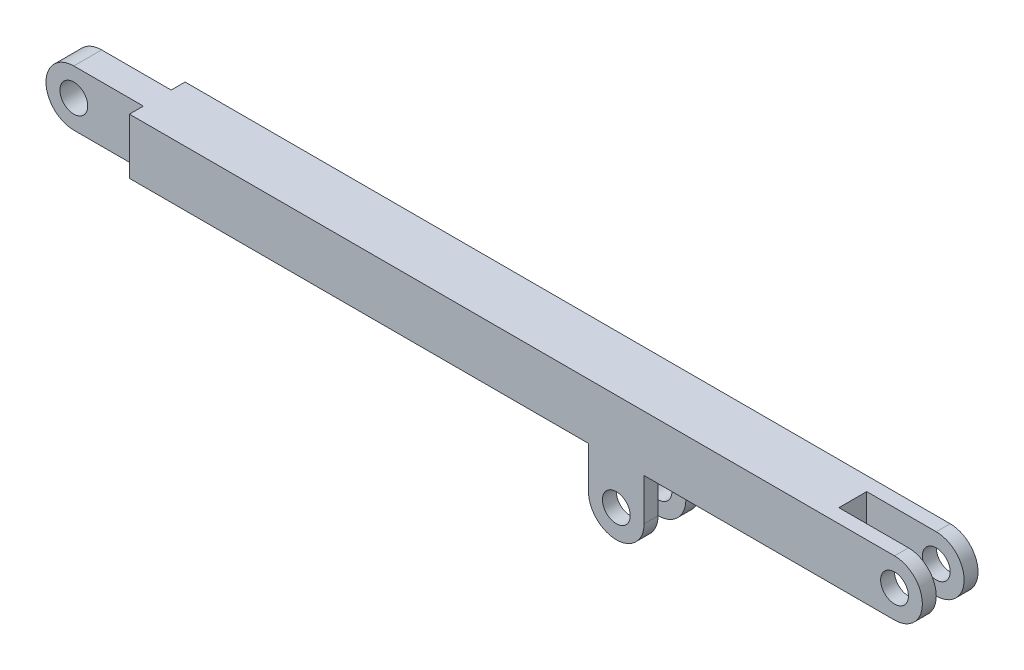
ISO-10303-21;
HEADER;
FILE_DESCRIPTION(('STEP AP214'),'2;1');
FILE_NAME('part.step','',(''),(''),'','','');
FILE_SCHEMA(('AUTOMOTIVE_DESIGN { 1 0 10303 214 1 1 1 1 }'));
ENDSEC;
DATA;
#1=APPLICATION_CONTEXT('core data for automotive mechanical design processes');
#2=APPLICATION_PROTOCOL_DEFINITION('international standard','automotive_design',2000,#1);
#3=PRODUCT_CONTEXT('',#1,'mechanical');
#4=PRODUCT('Part','Part','',(#3));
#5=PRODUCT_RELATED_PRODUCT_CATEGORY('part','',(#4));
#6=PRODUCT_DEFINITION_FORMATION('','',#4);
#7=PRODUCT_DEFINITION_CONTEXT('part definition',#1,'design');
#8=PRODUCT_DEFINITION('design','',#6,#7);
#9=PRODUCT_DEFINITION_SHAPE('','',#8);
#10=(LENGTH_UNIT() NAMED_UNIT(*) SI_UNIT(.MILLI.,.METRE.));
#11=(NAMED_UNIT(*) PLANE_ANGLE_UNIT() SI_UNIT($,.RADIAN.));
#12=(NAMED_UNIT(*) SI_UNIT($,.STERADIAN.) SOLID_ANGLE_UNIT());
#13=UNCERTAINTY_MEASURE_WITH_UNIT(LENGTH_MEASURE(1.E-05),#10,'distance_accuracy_value','');
#14=(GEOMETRIC_REPRESENTATION_CONTEXT(3) GLOBAL_UNCERTAINTY_ASSIGNED_CONTEXT((#13)) GLOBAL_UNIT_ASSIGNED_CONTEXT((#10,
#11,#12)) REPRESENTATION_CONTEXT('',''));
#15=CARTESIAN_POINT('',(0.,0.,0.));
#16=DIRECTION('',(0.,0.,1.));
#17=DIRECTION('',(1.,0.,0.));
#18=AXIS2_PLACEMENT_3D('',#15,#16,#17);
#19=CARTESIAN_POINT('',(760.,-100.,40.));
#20=DIRECTION('',(1.,0.,0.));
#21=DIRECTION('',(0.,0.,-1.));
#22=AXIS2_PLACEMENT_3D('',#19,#20,#21);
#23=PLANE('',#22);
#24=DIRECTION('',(0.,-1.,0.));
#25=VECTOR('',#24,1.);
#26=CARTESIAN_POINT('',(760.,-100.,20.));
#27=LINE('',#26,#25);
#28=CARTESIAN_POINT('',(760.,-40.,20.));
#29=VERTEX_POINT('',#28);
#30=CARTESIAN_POINT('',(760.,-100.,20.));
#31=VERTEX_POINT('',#30);
#32=EDGE_CURVE('E380',#29,#31,#27,.T.);
#33=ORIENTED_EDGE('',*,*,#32,.T.);
#34=DIRECTION('',(0.,0.,-1.));
#35=VECTOR('',#34,1.);
#36=CARTESIAN_POINT('',(760.,-100.,40.));
#37=LINE('',#36,#35);
#38=CARTESIAN_POINT('',(760.,-100.,40.));
#39=VERTEX_POINT('',#38);
#40=EDGE_CURVE('E193',#39,#31,#37,.T.);
#41=ORIENTED_EDGE('',*,*,#40,.F.);
#42=DIRECTION('',(0.,-1.,0.));
#43=VECTOR('',#42,1.);
#44=CARTESIAN_POINT('',(760.,-100.,40.));
#45=LINE('',#44,#43);
#46=CARTESIAN_POINT('',(760.,-40.,40.));
#47=VERTEX_POINT('',#46);
#48=EDGE_CURVE('E359',#47,#39,#45,.T.);
#49=ORIENTED_EDGE('',*,*,#48,.F.);
#50=DIRECTION('',(0.,0.,-1.));
#51=VECTOR('',#50,1.);
#52=CARTESIAN_POINT('',(760.,-40.,40.));
#53=LINE('',#52,#51);
#54=EDGE_CURVE('E352',#47,#29,#53,.T.);
#55=ORIENTED_EDGE('',*,*,#54,.T.);
#56=EDGE_LOOP('',(#33,#41,#49,#55));
#57=FACE_BOUND('',#56,.T.);
#58=ADVANCED_FACE('F32',(#57),#23,.F.);
#59=CARTESIAN_POINT('',(800.,-100.,40.));
#60=DIRECTION('',(0.,0.,-1.));
#61=DIRECTION('',(-1.,0.,0.));
#62=AXIS2_PLACEMENT_3D('',#59,#60,#61);
#63=CYLINDRICAL_SURFACE('',#62,40.);
#64=CARTESIAN_POINT('',(800.,-100.,20.));
#65=DIRECTION('',(0.,0.,1.));
#66=DIRECTION('',(-1.,0.,0.));
#67=AXIS2_PLACEMENT_3D('',#64,#65,#66);
#68=CIRCLE('',#67,40.);
#69=CARTESIAN_POINT('',(840.,-100.,20.));
#70=VERTEX_POINT('',#69);
#71=EDGE_CURVE('E377',#31,#70,#68,.T.);
#72=ORIENTED_EDGE('',*,*,#71,.T.);
#73=DIRECTION('',(0.,0.,-1.));
#74=VECTOR('',#73,1.);
#75=CARTESIAN_POINT('',(840.,-100.,40.));
#76=LINE('',#75,#74);
#77=CARTESIAN_POINT('',(840.,-100.,40.));
#78=VERTEX_POINT('',#77);
#79=EDGE_CURVE('E194',#78,#70,#76,.T.);
#80=ORIENTED_EDGE('',*,*,#79,.F.);
#81=CARTESIAN_POINT('',(800.,-100.,40.));
#82=DIRECTION('',(0.,0.,1.));
#83=DIRECTION('',(-1.,0.,0.));
#84=AXIS2_PLACEMENT_3D('',#81,#82,#83);
#85=CIRCLE('',#84,40.);
#86=EDGE_CURVE('E365',#39,#78,#85,.T.);
#87=ORIENTED_EDGE('',*,*,#86,.F.);
#88=ORIENTED_EDGE('',*,*,#40,.T.);
#89=EDGE_LOOP('',(#72,#80,#87,#88));
#90=FACE_BOUND('',#89,.T.);
#91=ADVANCED_FACE('F408',(#90),#63,.T.);
#92=CARTESIAN_POINT('',(840.,-40.,40.));
#93=DIRECTION('',(-1.,0.,0.));
#94=DIRECTION('',(0.,0.,1.));
#95=AXIS2_PLACEMENT_3D('',#92,#93,#94);
#96=PLANE('',#95);
#97=DIRECTION('',(0.,1.,0.));
#98=VECTOR('',#97,1.);
#99=CARTESIAN_POINT('',(840.,-40.,20.));
#100=LINE('',#99,#98);
#101=CARTESIAN_POINT('',(840.,-40.,20.));
#102=VERTEX_POINT('',#101);
#103=EDGE_CURVE('E375',#70,#102,#100,.T.);
#104=ORIENTED_EDGE('',*,*,#103,.T.);
#105=DIRECTION('',(0.,0.,-1.));
#106=VECTOR('',#105,1.);
#107=CARTESIAN_POINT('',(840.,-40.,40.));
#108=LINE('',#107,#106);
#109=CARTESIAN_POINT('',(840.,-40.,40.));
#110=VERTEX_POINT('',#109);
#111=EDGE_CURVE('E54',#110,#102,#108,.T.);
#112=ORIENTED_EDGE('',*,*,#111,.F.);
#113=DIRECTION('',(0.,1.,0.));
#114=VECTOR('',#113,1.);
#115=CARTESIAN_POINT('',(840.,-40.,40.));
#116=LINE('',#115,#114);
#117=EDGE_CURVE('E348',#78,#110,#116,.T.);
#118=ORIENTED_EDGE('',*,*,#117,.F.);
#119=ORIENTED_EDGE('',*,*,#79,.T.);
#120=EDGE_LOOP('',(#104,#112,#118,#119));
#121=FACE_BOUND('',#120,.T.);
#122=ADVANCED_FACE('F414',(#121),#96,.F.);
#123=CARTESIAN_POINT('',(800.,-100.,40.));
#124=DIRECTION('',(0.,0.,-1.));
#125=DIRECTION('',(-1.,0.,0.));
#126=AXIS2_PLACEMENT_3D('',#123,#124,#125);
#127=CYLINDRICAL_SURFACE('',#126,20.);
#128=CARTESIAN_POINT('',(800.,-100.,40.));
#129=DIRECTION('',(0.,0.,1.));
#130=DIRECTION('',(1.,0.,0.));
#131=AXIS2_PLACEMENT_3D('',#128,#129,#130);
#132=CIRCLE('',#131,20.);
#133=CARTESIAN_POINT('',(820.,-100.,40.));
#134=VERTEX_POINT('',#133);
#135=EDGE_CURVE('E363',#134,#134,#132,.T.);
#136=ORIENTED_EDGE('',*,*,#135,.T.);
#137=EDGE_LOOP('',(#136));
#138=FACE_BOUND('',#137,.T.);
#139=CARTESIAN_POINT('',(800.,-100.,20.));
#140=DIRECTION('',(0.,0.,1.));
#141=DIRECTION('',(1.,0.,0.));
#142=AXIS2_PLACEMENT_3D('',#139,#140,#141);
#143=CIRCLE('',#142,20.);
#144=CARTESIAN_POINT('',(820.,-100.,20.));
#145=VERTEX_POINT('',#144);
#146=EDGE_CURVE('E386',#145,#145,#143,.T.);
#147=ORIENTED_EDGE('',*,*,#146,.F.);
#148=EDGE_LOOP('',(#147));
#149=FACE_BOUND('',#148,.T.);
#150=ADVANCED_FACE('F406',(#138,#149),#127,.F.);
#151=CARTESIAN_POINT('',(0.,-40.,20.));
#152=DIRECTION('',(0.,1.,0.));
#153=DIRECTION('',(0.,0.,1.));
#154=AXIS2_PLACEMENT_3D('',#151,#152,#153);
#155=PLANE('',#154);
#156=ORIENTED_EDGE('',*,*,#111,.T.);
#157=DIRECTION('',(-1.,0.,0.));
#158=VECTOR('',#157,1.);
#159=CARTESIAN_POINT('',(760.,-40.,20.));
#160=LINE('',#159,#158);
#161=EDGE_CURVE('E47',#102,#29,#160,.T.);
#162=ORIENTED_EDGE('',*,*,#161,.T.);
#163=ORIENTED_EDGE('',*,*,#54,.F.);
#164=DIRECTION('',(1.,0.,0.));
#165=VECTOR('',#164,1.);
#166=CARTESIAN_POINT('',(99.9999999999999,-40.0000000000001,40.));
#167=LINE('',#166,#165);
#168=CARTESIAN_POINT('',(99.9999999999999,-40.0000000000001,40.));
#169=VERTEX_POINT('',#168);
#170=EDGE_CURVE('E250',#169,#47,#167,.T.);
#171=ORIENTED_EDGE('',*,*,#170,.F.);
#172=DIRECTION('',(0.,0.,-1.));
#173=VECTOR('',#172,1.);
#174=CARTESIAN_POINT('',(99.9999999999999,-40.0000000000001,40.));
#175=LINE('',#174,#173);
#176=CARTESIAN_POINT('',(99.9999999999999,-40.,20.));
#177=VERTEX_POINT('',#176);
#178=EDGE_CURVE('E265',#169,#177,#175,.T.);
#179=ORIENTED_EDGE('',*,*,#178,.T.);
#180=DIRECTION('',(1.,0.,0.));
#181=VECTOR('',#180,1.);
#182=CARTESIAN_POINT('',(0.,-40.,20.));
#183=LINE('',#182,#181);
#184=CARTESIAN_POINT('',(0.,-40.,20.));
#185=VERTEX_POINT('',#184);
#186=EDGE_CURVE('E286',#185,#177,#183,.T.);
#187=ORIENTED_EDGE('',*,*,#186,.F.);
#188=DIRECTION('',(0.,0.,-1.));
#189=VECTOR('',#188,1.);
#190=CARTESIAN_POINT('',(0.,-40.,20.));
#191=LINE('',#190,#189);
#192=CARTESIAN_POINT('',(0.,-40.,-20.));
#193=VERTEX_POINT('',#192);
#194=EDGE_CURVE('E11',#185,#193,#191,.T.);
#195=ORIENTED_EDGE('',*,*,#194,.T.);
#196=DIRECTION('',(1.,0.,0.));
#197=VECTOR('',#196,1.);
#198=CARTESIAN_POINT('',(0.,-40.,-20.));
#199=LINE('',#198,#197);
#200=CARTESIAN_POINT('',(99.9999999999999,-40.0000000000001,-20.));
#201=VERTEX_POINT('',#200);
#202=EDGE_CURVE('E294',#193,#201,#199,.T.);
#203=ORIENTED_EDGE('',*,*,#202,.T.);
#204=CARTESIAN_POINT('',(99.9999999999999,-40.0000000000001,-40.));
#205=VERTEX_POINT('',#204);
#206=EDGE_CURVE('E253',#201,#205,#175,.T.);
#207=ORIENTED_EDGE('',*,*,#206,.T.);
#208=DIRECTION('',(1.,0.,0.));
#209=VECTOR('',#208,1.);
#210=CARTESIAN_POINT('',(99.9999999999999,-40.0000000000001,-40.));
#211=LINE('',#210,#209);
#212=CARTESIAN_POINT('',(760.,-40.,-40.));
#213=VERTEX_POINT('',#212);
#214=EDGE_CURVE('E245',#205,#213,#211,.T.);
#215=ORIENTED_EDGE('',*,*,#214,.T.);
#216=CARTESIAN_POINT('',(760.,-40.,-20.));
#217=VERTEX_POINT('',#216);
#218=EDGE_CURVE('E355',#217,#213,#53,.T.);
#219=ORIENTED_EDGE('',*,*,#218,.F.);
#220=DIRECTION('',(-1.,0.,0.));
#221=VECTOR('',#220,1.);
#222=CARTESIAN_POINT('',(760.,-40.,-20.));
#223=LINE('',#222,#221);
#224=CARTESIAN_POINT('',(840.,-40.,-20.));
#225=VERTEX_POINT('',#224);
#226=EDGE_CURVE('E175',#225,#217,#223,.T.);
#227=ORIENTED_EDGE('',*,*,#226,.F.);
#228=CARTESIAN_POINT('',(840.,-40.,-40.));
#229=VERTEX_POINT('',#228);
#230=EDGE_CURVE('E351',#225,#229,#108,.T.);
#231=ORIENTED_EDGE('',*,*,#230,.T.);
#232=CARTESIAN_POINT('',(1200.,-40.,-40.));
#233=VERTEX_POINT('',#232);
#234=EDGE_CURVE('E262',#229,#233,#211,.T.);
#235=ORIENTED_EDGE('',*,*,#234,.T.);
#236=DIRECTION('',(0.,0.,-1.));
#237=VECTOR('',#236,1.);
#238=CARTESIAN_POINT('',(1200.,-40.,20.));
#239=LINE('',#238,#237);
#240=CARTESIAN_POINT('',(1200.,-40.,-20.));
#241=VERTEX_POINT('',#240);
#242=EDGE_CURVE('E303',#241,#233,#239,.T.);
#243=ORIENTED_EDGE('',*,*,#242,.F.);
#244=DIRECTION('',(1.,0.,0.));
#245=VECTOR('',#244,1.);
#246=CARTESIAN_POINT('',(1100.,-40.,-20.));
#247=LINE('',#246,#245);
#248=CARTESIAN_POINT('',(1100.,-40.,-20.));
#249=VERTEX_POINT('',#248);
#250=EDGE_CURVE('E217',#249,#241,#247,.T.);
#251=ORIENTED_EDGE('',*,*,#250,.F.);
#252=DIRECTION('',(0.,0.,1.));
#253=VECTOR('',#252,1.);
#254=CARTESIAN_POINT('',(1100.,-40.,-20.));
#255=LINE('',#254,#253);
#256=CARTESIAN_POINT('',(1100.,-40.,20.));
#257=VERTEX_POINT('',#256);
#258=EDGE_CURVE('E229',#249,#257,#255,.T.);
#259=ORIENTED_EDGE('',*,*,#258,.T.);
#260=DIRECTION('',(1.,0.,0.));
#261=VECTOR('',#260,1.);
#262=CARTESIAN_POINT('',(1100.,-40.,20.));
#263=LINE('',#262,#261);
#264=CARTESIAN_POINT('',(1200.,-40.,20.));
#265=VERTEX_POINT('',#264);
#266=EDGE_CURVE('E211',#257,#265,#263,.T.);
#267=ORIENTED_EDGE('',*,*,#266,.T.);
#268=CARTESIAN_POINT('',(1200.,-40.,40.));
#269=VERTEX_POINT('',#268);
#270=EDGE_CURVE('E40',#269,#265,#239,.T.);
#271=ORIENTED_EDGE('',*,*,#270,.F.);
#272=EDGE_CURVE('E249',#110,#269,#167,.T.);
#273=ORIENTED_EDGE('',*,*,#272,.F.);
#274=EDGE_LOOP('',(#156,#162,#163,#171,#179,#187,#195,#203,#207,#215,#219,#227,#231,#235,#243,
#251,#259,#267,#271,#273));
#275=FACE_BOUND('',#274,.T.);
#276=ADVANCED_FACE('F333',(#275),#155,.F.);
#277=CARTESIAN_POINT('',(1200.,0.,20.));
#278=DIRECTION('',(0.,0.,-1.));
#279=DIRECTION('',(-1.,0.,0.));
#280=AXIS2_PLACEMENT_3D('',#277,#278,#279);
#281=CYLINDRICAL_SURFACE('',#280,40.);
#282=CARTESIAN_POINT('',(1200.,0.,-20.));
#283=DIRECTION('',(0.,0.,1.));
#284=DIRECTION('',(1.,0.,0.));
#285=AXIS2_PLACEMENT_3D('',#282,#283,#284);
#286=CIRCLE('',#285,40.);
#287=CARTESIAN_POINT('',(1200.,40.,-20.));
#288=VERTEX_POINT('',#287);
#289=EDGE_CURVE('E208',#241,#288,#286,.T.);
#290=ORIENTED_EDGE('',*,*,#289,.F.);
#291=ORIENTED_EDGE('',*,*,#242,.T.);
#292=CARTESIAN_POINT('',(1200.,0.,-40.));
#293=DIRECTION('',(0.,0.,1.));
#294=DIRECTION('',(1.,0.,0.));
#295=AXIS2_PLACEMENT_3D('',#292,#293,#294);
#296=CIRCLE('',#295,40.);
#297=CARTESIAN_POINT('',(1200.,40.,-40.));
#298=VERTEX_POINT('',#297);
#299=EDGE_CURVE('E238',#233,#298,#296,.T.);
#300=ORIENTED_EDGE('',*,*,#299,.T.);
#301=DIRECTION('',(0.,0.,-1.));
#302=VECTOR('',#301,1.);
#303=CARTESIAN_POINT('',(1200.,40.,20.));
#304=LINE('',#303,#302);
#305=EDGE_CURVE('E300',#288,#298,#304,.T.);
#306=ORIENTED_EDGE('',*,*,#305,.F.);
#307=EDGE_LOOP('',(#290,#291,#300,#306));
#308=FACE_BOUND('',#307,.T.);
#309=ADVANCED_FACE('F313',(#308),#281,.T.);
#310=CARTESIAN_POINT('',(0.,40.,20.));
#311=DIRECTION('',(0.,-1.,0.));
#312=DIRECTION('',(0.,0.,-1.));
#313=AXIS2_PLACEMENT_3D('',#310,#311,#312);
#314=PLANE('',#313);
#315=DIRECTION('',(-1.,0.,0.));
#316=VECTOR('',#315,1.);
#317=CARTESIAN_POINT('',(1100.,40.0000000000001,-20.));
#318=LINE('',#317,#316);
#319=CARTESIAN_POINT('',(1100.,40.0000000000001,-20.));
#320=VERTEX_POINT('',#319);
#321=EDGE_CURVE('E210',#288,#320,#318,.T.);
#322=ORIENTED_EDGE('',*,*,#321,.F.);
#323=ORIENTED_EDGE('',*,*,#305,.T.);
#324=DIRECTION('',(-1.,0.,0.));
#325=VECTOR('',#324,1.);
#326=CARTESIAN_POINT('',(99.9999999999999,40.,-40.));
#327=LINE('',#326,#325);
#328=CARTESIAN_POINT('',(99.9999999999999,40.,-40.));
#329=VERTEX_POINT('',#328);
#330=EDGE_CURVE('E256',#298,#329,#327,.T.);
#331=ORIENTED_EDGE('',*,*,#330,.T.);
#332=DIRECTION('',(0.,0.,-1.));
#333=VECTOR('',#332,1.);
#334=CARTESIAN_POINT('',(99.9999999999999,40.,40.));
#335=LINE('',#334,#333);
#336=CARTESIAN_POINT('',(99.9999999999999,40.,-20.));
#337=VERTEX_POINT('',#336);
#338=EDGE_CURVE('E268',#337,#329,#335,.T.);
#339=ORIENTED_EDGE('',*,*,#338,.F.);
#340=DIRECTION('',(-1.,0.,0.));
#341=VECTOR('',#340,1.);
#342=CARTESIAN_POINT('',(0.,40.,-20.));
#343=LINE('',#342,#341);
#344=CARTESIAN_POINT('',(0.,40.,-20.));
#345=VERTEX_POINT('',#344);
#346=EDGE_CURVE('E287',#337,#345,#343,.T.);
#347=ORIENTED_EDGE('',*,*,#346,.T.);
#348=DIRECTION('',(0.,0.,-1.));
#349=VECTOR('',#348,1.);
#350=CARTESIAN_POINT('',(0.,40.,20.));
#351=LINE('',#350,#349);
#352=CARTESIAN_POINT('',(0.,40.,20.));
#353=VERTEX_POINT('',#352);
#354=EDGE_CURVE('E291',#353,#345,#351,.T.);
#355=ORIENTED_EDGE('',*,*,#354,.F.);
#356=DIRECTION('',(-1.,0.,0.));
#357=VECTOR('',#356,1.);
#358=CARTESIAN_POINT('',(0.,40.,20.));
#359=LINE('',#358,#357);
#360=CARTESIAN_POINT('',(99.9999999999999,40.,20.));
#361=VERTEX_POINT('',#360);
#362=EDGE_CURVE('E289',#361,#353,#359,.T.);
#363=ORIENTED_EDGE('',*,*,#362,.F.);
#364=CARTESIAN_POINT('',(99.9999999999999,40.,40.));
#365=VERTEX_POINT('',#364);
#366=EDGE_CURVE('E269',#365,#361,#335,.T.);
#367=ORIENTED_EDGE('',*,*,#366,.F.);
#368=DIRECTION('',(-1.,0.,0.));
#369=VECTOR('',#368,1.);
#370=CARTESIAN_POINT('',(99.9999999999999,40.,40.));
#371=LINE('',#370,#369);
#372=CARTESIAN_POINT('',(1200.,40.,40.));
#373=VERTEX_POINT('',#372);
#374=EDGE_CURVE('E244',#373,#365,#371,.T.);
#375=ORIENTED_EDGE('',*,*,#374,.F.);
#376=CARTESIAN_POINT('',(1200.,40.,20.));
#377=VERTEX_POINT('',#376);
#378=EDGE_CURVE('E301',#373,#377,#304,.T.);
#379=ORIENTED_EDGE('',*,*,#378,.T.);
#380=DIRECTION('',(-1.,0.,0.));
#381=VECTOR('',#380,1.);
#382=CARTESIAN_POINT('',(1100.,40.0000000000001,20.));
#383=LINE('',#382,#381);
#384=CARTESIAN_POINT('',(1100.,40.,20.));
#385=VERTEX_POINT('',#384);
#386=EDGE_CURVE('E222',#377,#385,#383,.T.);
#387=ORIENTED_EDGE('',*,*,#386,.T.);
#388=DIRECTION('',(0.,0.,1.));
#389=VECTOR('',#388,1.);
#390=CARTESIAN_POINT('',(1100.,40.0000000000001,-20.));
#391=LINE('',#390,#389);
#392=EDGE_CURVE('E219',#320,#385,#391,.T.);
#393=ORIENTED_EDGE('',*,*,#392,.F.);
#394=EDGE_LOOP('',(#322,#323,#331,#339,#347,#355,#363,#367,#375,#379,#387,#393));
#395=FACE_BOUND('',#394,.T.);
#396=ADVANCED_FACE('F328',(#395),#314,.F.);
#397=CARTESIAN_POINT('',(1200.,0.,20.));
#398=DIRECTION('',(0.,0.,-1.));
#399=DIRECTION('',(-1.,0.,0.));
#400=AXIS2_PLACEMENT_3D('',#397,#398,#399);
#401=CYLINDRICAL_SURFACE('',#400,20.);
#402=CARTESIAN_POINT('',(1200.,0.,-40.));
#403=DIRECTION('',(0.,0.,1.));
#404=DIRECTION('',(1.,0.,0.));
#405=AXIS2_PLACEMENT_3D('',#402,#403,#404);
#406=CIRCLE('',#405,20.);
#407=CARTESIAN_POINT('',(1220.,0.,-40.));
#408=VERTEX_POINT('',#407);
#409=EDGE_CURVE('E232',#408,#408,#406,.T.);
#410=ORIENTED_EDGE('',*,*,#409,.F.);
#411=EDGE_LOOP('',(#410));
#412=FACE_BOUND('',#411,.T.);
#413=CARTESIAN_POINT('',(1200.,0.,-20.));
#414=DIRECTION('',(0.,0.,1.));
#415=DIRECTION('',(1.,0.,0.));
#416=AXIS2_PLACEMENT_3D('',#413,#414,#415);
#417=CIRCLE('',#416,20.);
#418=CARTESIAN_POINT('',(1220.,0.,-20.));
#419=VERTEX_POINT('',#418);
#420=EDGE_CURVE('E202',#419,#419,#417,.T.);
#421=ORIENTED_EDGE('',*,*,#420,.T.);
#422=EDGE_LOOP('',(#421));
#423=FACE_BOUND('',#422,.T.);
#424=ADVANCED_FACE('F445',(#412,#423),#401,.F.);
#425=CARTESIAN_POINT('',(0.,0.,20.));
#426=DIRECTION('',(0.,0.,1.));
#427=DIRECTION('',(1.,0.,0.));
#428=AXIS2_PLACEMENT_3D('',#425,#426,#427);
#429=PLANE('',#428);
#430=CARTESIAN_POINT('',(0.,0.,20.));
#431=DIRECTION('',(0.,0.,1.));
#432=DIRECTION('',(1.,0.,0.));
#433=AXIS2_PLACEMENT_3D('',#430,#431,#432);
#434=CIRCLE('',#433,20.);
#435=CARTESIAN_POINT('',(20.,0.,20.));
#436=VERTEX_POINT('',#435);
#437=EDGE_CURVE('E277',#436,#436,#434,.T.);
#438=ORIENTED_EDGE('',*,*,#437,.F.);
#439=EDGE_LOOP('',(#438));
#440=FACE_BOUND('',#439,.T.);
#441=ORIENTED_EDGE('',*,*,#186,.T.);
#442=DIRECTION('',(0.,1.,0.));
#443=VECTOR('',#442,1.);
#444=CARTESIAN_POINT('',(99.9999999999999,0.,20.));
#445=LINE('',#444,#443);
#446=EDGE_CURVE('E274',#177,#361,#445,.T.);
#447=ORIENTED_EDGE('',*,*,#446,.T.);
#448=ORIENTED_EDGE('',*,*,#362,.T.);
#449=CARTESIAN_POINT('',(0.,0.,20.));
#450=DIRECTION('',(0.,0.,1.));
#451=DIRECTION('',(1.,0.,0.));
#452=AXIS2_PLACEMENT_3D('',#449,#450,#451);
#453=CIRCLE('',#452,40.);
#454=EDGE_CURVE('E283',#353,#185,#453,.T.);
#455=ORIENTED_EDGE('',*,*,#454,.T.);
#456=EDGE_LOOP('',(#441,#447,#448,#455));
#457=FACE_BOUND('',#456,.T.);
#458=ADVANCED_FACE('F450',(#440,#457),#429,.T.);
#459=CARTESIAN_POINT('',(0.,0.,-20.));
#460=DIRECTION('',(0.,0.,1.));
#461=DIRECTION('',(1.,0.,0.));
#462=AXIS2_PLACEMENT_3D('',#459,#460,#461);
#463=PLANE('',#462);
#464=CARTESIAN_POINT('',(0.,0.,-20.));
#465=DIRECTION('',(0.,0.,1.));
#466=DIRECTION('',(1.,0.,0.));
#467=AXIS2_PLACEMENT_3D('',#464,#465,#466);
#468=CIRCLE('',#467,20.);
#469=CARTESIAN_POINT('',(20.,0.,-20.));
#470=VERTEX_POINT('',#469);
#471=EDGE_CURVE('E276',#470,#470,#468,.T.);
#472=ORIENTED_EDGE('',*,*,#471,.T.);
#473=EDGE_LOOP('',(#472));
#474=FACE_BOUND('',#473,.T.);
#475=DIRECTION('',(0.,1.,0.));
#476=VECTOR('',#475,1.);
#477=CARTESIAN_POINT('',(99.9999999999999,0.,-20.));
#478=LINE('',#477,#476);
#479=EDGE_CURVE('E272',#201,#337,#478,.T.);
#480=ORIENTED_EDGE('',*,*,#479,.F.);
#481=ORIENTED_EDGE('',*,*,#202,.F.);
#482=CARTESIAN_POINT('',(0.,0.,-20.));
#483=DIRECTION('',(0.,0.,1.));
#484=DIRECTION('',(1.,0.,0.));
#485=AXIS2_PLACEMENT_3D('',#482,#483,#484);
#486=CIRCLE('',#485,40.);
#487=EDGE_CURVE('E280',#345,#193,#486,.T.);
#488=ORIENTED_EDGE('',*,*,#487,.F.);
#489=ORIENTED_EDGE('',*,*,#346,.F.);
#490=EDGE_LOOP('',(#480,#481,#488,#489));
#491=FACE_BOUND('',#490,.T.);
#492=ADVANCED_FACE('F453',(#474,#491),#463,.F.);
#493=CARTESIAN_POINT('',(0.,0.,20.));
#494=DIRECTION('',(0.,0.,-1.));
#495=DIRECTION('',(-1.,0.,0.));
#496=AXIS2_PLACEMENT_3D('',#493,#494,#495);
#497=CYLINDRICAL_SURFACE('',#496,40.);
#498=ORIENTED_EDGE('',*,*,#487,.T.);
#499=ORIENTED_EDGE('',*,*,#194,.F.);
#500=ORIENTED_EDGE('',*,*,#454,.F.);
#501=ORIENTED_EDGE('',*,*,#354,.T.);
#502=EDGE_LOOP('',(#498,#499,#500,#501));
#503=FACE_BOUND('',#502,.T.);
#504=ADVANCED_FACE('F34',(#503),#497,.T.);
#505=ORIENTED_EDGE('',*,*,#270,.T.);
#506=CARTESIAN_POINT('',(1200.,0.,20.));
#507=DIRECTION('',(0.,0.,1.));
#508=DIRECTION('',(1.,0.,0.));
#509=AXIS2_PLACEMENT_3D('',#506,#507,#508);
#510=CIRCLE('',#509,40.);
#511=EDGE_CURVE('E205',#265,#377,#510,.T.);
#512=ORIENTED_EDGE('',*,*,#511,.T.);
#513=ORIENTED_EDGE('',*,*,#378,.F.);
#514=CARTESIAN_POINT('',(1200.,0.,40.));
#515=DIRECTION('',(0.,0.,1.));
#516=DIRECTION('',(1.,0.,0.));
#517=AXIS2_PLACEMENT_3D('',#514,#515,#516);
#518=CIRCLE('',#517,40.);
#519=EDGE_CURVE('E241',#269,#373,#518,.T.);
#520=ORIENTED_EDGE('',*,*,#519,.F.);
#521=EDGE_LOOP('',(#505,#512,#513,#520));
#522=FACE_BOUND('',#521,.T.);
#523=ADVANCED_FACE('F339',(#522),#281,.T.);
#524=CARTESIAN_POINT('',(0.,0.,20.));
#525=DIRECTION('',(0.,0.,-1.));
#526=DIRECTION('',(-1.,0.,0.));
#527=AXIS2_PLACEMENT_3D('',#524,#525,#526);
#528=CYLINDRICAL_SURFACE('',#527,20.);
#529=ORIENTED_EDGE('',*,*,#437,.T.);
#530=EDGE_LOOP('',(#529));
#531=FACE_BOUND('',#530,.T.);
#532=ORIENTED_EDGE('',*,*,#471,.F.);
#533=EDGE_LOOP('',(#532));
#534=FACE_BOUND('',#533,.T.);
#535=ADVANCED_FACE('F446',(#531,#534),#528,.F.);
#536=CARTESIAN_POINT('',(99.9999999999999,40.,40.));
#537=DIRECTION('',(1.,0.,0.));
#538=DIRECTION('',(0.,1.,0.));
#539=AXIS2_PLACEMENT_3D('',#536,#537,#538);
#540=PLANE('',#539);
#541=ORIENTED_EDGE('',*,*,#206,.F.);
#542=ORIENTED_EDGE('',*,*,#479,.T.);
#543=ORIENTED_EDGE('',*,*,#338,.T.);
#544=DIRECTION('',(0.,-1.,0.));
#545=VECTOR('',#544,1.);
#546=CARTESIAN_POINT('',(99.9999999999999,40.,-40.));
#547=LINE('',#546,#545);
#548=EDGE_CURVE('E259',#329,#205,#547,.T.);
#549=ORIENTED_EDGE('',*,*,#548,.T.);
#550=EDGE_LOOP('',(#541,#542,#543,#549));
#551=FACE_BOUND('',#550,.T.);
#552=ADVANCED_FACE('F438',(#551),#540,.F.);
#553=CARTESIAN_POINT('',(1200.,0.,-40.));
#554=DIRECTION('',(0.,0.,1.));
#555=DIRECTION('',(1.,0.,0.));
#556=AXIS2_PLACEMENT_3D('',#553,#554,#555);
#557=PLANE('',#556);
#558=ORIENTED_EDGE('',*,*,#299,.F.);
#559=ORIENTED_EDGE('',*,*,#234,.F.);
#560=DIRECTION('',(0.,1.,0.));
#561=VECTOR('',#560,1.);
#562=CARTESIAN_POINT('',(840.,-40.,-40.));
#563=LINE('',#562,#561);
#564=CARTESIAN_POINT('',(840.,-100.,-40.));
#565=VERTEX_POINT('',#564);
#566=EDGE_CURVE('E356',#565,#229,#563,.T.);
#567=ORIENTED_EDGE('',*,*,#566,.F.);
#568=CARTESIAN_POINT('',(800.,-100.,-40.));
#569=DIRECTION('',(0.,0.,1.));
#570=DIRECTION('',(-1.,0.,0.));
#571=AXIS2_PLACEMENT_3D('',#568,#569,#570);
#572=CIRCLE('',#571,40.);
#573=CARTESIAN_POINT('',(760.,-100.,-40.));
#574=VERTEX_POINT('',#573);
#575=EDGE_CURVE('E360',#574,#565,#572,.T.);
#576=ORIENTED_EDGE('',*,*,#575,.F.);
#577=DIRECTION('',(0.,-1.,0.));
#578=VECTOR('',#577,1.);
#579=CARTESIAN_POINT('',(760.,-100.,-40.));
#580=LINE('',#579,#578);
#581=EDGE_CURVE('E192',#213,#574,#580,.T.);
#582=ORIENTED_EDGE('',*,*,#581,.F.);
#583=ORIENTED_EDGE('',*,*,#214,.F.);
#584=ORIENTED_EDGE('',*,*,#548,.F.);
#585=ORIENTED_EDGE('',*,*,#330,.F.);
#586=EDGE_LOOP('',(#558,#559,#567,#576,#582,#583,#584,#585));
#587=FACE_BOUND('',#586,.T.);
#588=ORIENTED_EDGE('',*,*,#409,.T.);
#589=EDGE_LOOP('',(#588));
#590=FACE_BOUND('',#589,.T.);
#591=CARTESIAN_POINT('',(800.,-100.,-40.));
#592=DIRECTION('',(0.,0.,1.));
#593=DIRECTION('',(1.,0.,0.));
#594=AXIS2_PLACEMENT_3D('',#591,#592,#593);
#595=CIRCLE('',#594,20.);
#596=CARTESIAN_POINT('',(820.,-100.,-40.));
#597=VERTEX_POINT('',#596);
#598=EDGE_CURVE('E369',#597,#597,#595,.T.);
#599=ORIENTED_EDGE('',*,*,#598,.T.);
#600=EDGE_LOOP('',(#599));
#601=FACE_BOUND('',#600,.T.);
#602=ADVANCED_FACE('F320',(#587,#590,#601),#557,.F.);
#603=CARTESIAN_POINT('',(1200.,0.,20.));
#604=DIRECTION('',(0.,0.,1.));
#605=DIRECTION('',(1.,0.,0.));
#606=AXIS2_PLACEMENT_3D('',#603,#604,#605);
#607=CIRCLE('',#606,20.);
#608=CARTESIAN_POINT('',(1220.,0.,20.));
#609=VERTEX_POINT('',#608);
#610=EDGE_CURVE('E197',#609,#609,#607,.T.);
#611=ORIENTED_EDGE('',*,*,#610,.F.);
#612=EDGE_LOOP('',(#611));
#613=FACE_BOUND('',#612,.T.);
#614=CARTESIAN_POINT('',(1200.,0.,40.));
#615=DIRECTION('',(0.,0.,1.));
#616=DIRECTION('',(1.,0.,0.));
#617=AXIS2_PLACEMENT_3D('',#614,#615,#616);
#618=CIRCLE('',#617,20.);
#619=CARTESIAN_POINT('',(1220.,0.,40.));
#620=VERTEX_POINT('',#619);
#621=EDGE_CURVE('E235',#620,#620,#618,.T.);
#622=ORIENTED_EDGE('',*,*,#621,.T.);
#623=EDGE_LOOP('',(#622));
#624=FACE_BOUND('',#623,.T.);
#625=ADVANCED_FACE('F435',(#613,#624),#401,.F.);
#626=CARTESIAN_POINT('',(1200.,0.,40.));
#627=DIRECTION('',(0.,0.,1.));
#628=DIRECTION('',(1.,0.,0.));
#629=AXIS2_PLACEMENT_3D('',#626,#627,#628);
#630=PLANE('',#629);
#631=ORIENTED_EDGE('',*,*,#519,.T.);
#632=ORIENTED_EDGE('',*,*,#374,.T.);
#633=DIRECTION('',(0.,-1.,0.));
#634=VECTOR('',#633,1.);
#635=CARTESIAN_POINT('',(99.9999999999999,40.,40.));
#636=LINE('',#635,#634);
#637=EDGE_CURVE('E247',#365,#169,#636,.T.);
#638=ORIENTED_EDGE('',*,*,#637,.T.);
#639=ORIENTED_EDGE('',*,*,#170,.T.);
#640=ORIENTED_EDGE('',*,*,#48,.T.);
#641=ORIENTED_EDGE('',*,*,#86,.T.);
#642=ORIENTED_EDGE('',*,*,#117,.T.);
#643=ORIENTED_EDGE('',*,*,#272,.T.);
#644=EDGE_LOOP('',(#631,#632,#638,#639,#640,#641,#642,#643));
#645=FACE_BOUND('',#644,.T.);
#646=ORIENTED_EDGE('',*,*,#621,.F.);
#647=EDGE_LOOP('',(#646));
#648=FACE_BOUND('',#647,.T.);
#649=ORIENTED_EDGE('',*,*,#135,.F.);
#650=EDGE_LOOP('',(#649));
#651=FACE_BOUND('',#650,.T.);
#652=ADVANCED_FACE('F345',(#645,#648,#651),#630,.T.);
#653=ORIENTED_EDGE('',*,*,#446,.F.);
#654=ORIENTED_EDGE('',*,*,#178,.F.);
#655=ORIENTED_EDGE('',*,*,#637,.F.);
#656=ORIENTED_EDGE('',*,*,#366,.T.);
#657=EDGE_LOOP('',(#653,#654,#655,#656));
#658=FACE_BOUND('',#657,.T.);
#659=ADVANCED_FACE('F432',(#658),#540,.F.);
#660=CARTESIAN_POINT('',(1100.,40.0000000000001,-20.));
#661=DIRECTION('',(-1.,0.,0.));
#662=DIRECTION('',(0.,0.,1.));
#663=AXIS2_PLACEMENT_3D('',#660,#661,#662);
#664=PLANE('',#663);
#665=DIRECTION('',(0.,-1.,0.));
#666=VECTOR('',#665,1.);
#667=CARTESIAN_POINT('',(1100.,40.0000000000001,20.));
#668=LINE('',#667,#666);
#669=EDGE_CURVE('E225',#385,#257,#668,.T.);
#670=ORIENTED_EDGE('',*,*,#669,.T.);
#671=ORIENTED_EDGE('',*,*,#258,.F.);
#672=DIRECTION('',(0.,-1.,0.));
#673=VECTOR('',#672,1.);
#674=CARTESIAN_POINT('',(1100.,40.0000000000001,-20.));
#675=LINE('',#674,#673);
#676=EDGE_CURVE('E214',#320,#249,#675,.T.);
#677=ORIENTED_EDGE('',*,*,#676,.F.);
#678=ORIENTED_EDGE('',*,*,#392,.T.);
#679=EDGE_LOOP('',(#670,#671,#677,#678));
#680=FACE_BOUND('',#679,.T.);
#681=ADVANCED_FACE('F336',(#680),#664,.F.);
#682=CARTESIAN_POINT('',(1200.,0.,-20.));
#683=DIRECTION('',(0.,0.,1.));
#684=DIRECTION('',(1.,0.,0.));
#685=AXIS2_PLACEMENT_3D('',#682,#683,#684);
#686=PLANE('',#685);
#687=ORIENTED_EDGE('',*,*,#420,.F.);
#688=EDGE_LOOP('',(#687));
#689=FACE_BOUND('',#688,.T.);
#690=ORIENTED_EDGE('',*,*,#289,.T.);
#691=ORIENTED_EDGE('',*,*,#321,.T.);
#692=ORIENTED_EDGE('',*,*,#676,.T.);
#693=ORIENTED_EDGE('',*,*,#250,.T.);
#694=EDGE_LOOP('',(#690,#691,#692,#693));
#695=FACE_BOUND('',#694,.T.);
#696=ADVANCED_FACE('F332',(#689,#695),#686,.T.);
#697=CARTESIAN_POINT('',(1200.,0.,20.));
#698=DIRECTION('',(0.,0.,1.));
#699=DIRECTION('',(1.,0.,0.));
#700=AXIS2_PLACEMENT_3D('',#697,#698,#699);
#701=PLANE('',#700);
#702=ORIENTED_EDGE('',*,*,#610,.T.);
#703=EDGE_LOOP('',(#702));
#704=FACE_BOUND('',#703,.T.);
#705=ORIENTED_EDGE('',*,*,#511,.F.);
#706=ORIENTED_EDGE('',*,*,#266,.F.);
#707=ORIENTED_EDGE('',*,*,#669,.F.);
#708=ORIENTED_EDGE('',*,*,#386,.F.);
#709=EDGE_LOOP('',(#705,#706,#707,#708));
#710=FACE_BOUND('',#709,.T.);
#711=ADVANCED_FACE('F338',(#704,#710),#701,.F.);
#712=CARTESIAN_POINT('',(760.,-100.,-20.));
#713=VERTEX_POINT('',#712);
#714=EDGE_CURVE('E184',#713,#574,#37,.T.);
#715=ORIENTED_EDGE('',*,*,#714,.F.);
#716=DIRECTION('',(0.,-1.,0.));
#717=VECTOR('',#716,1.);
#718=CARTESIAN_POINT('',(760.,-100.,-20.));
#719=LINE('',#718,#717);
#720=EDGE_CURVE('E169',#217,#713,#719,.T.);
#721=ORIENTED_EDGE('',*,*,#720,.F.);
#722=ORIENTED_EDGE('',*,*,#218,.T.);
#723=ORIENTED_EDGE('',*,*,#581,.T.);
#724=EDGE_LOOP('',(#715,#721,#722,#723));
#725=FACE_BOUND('',#724,.T.);
#726=ADVANCED_FACE('F190',(#725),#23,.F.);
#727=CARTESIAN_POINT('',(840.,-100.,-20.));
#728=VERTEX_POINT('',#727);
#729=EDGE_CURVE('E186',#728,#565,#76,.T.);
#730=ORIENTED_EDGE('',*,*,#729,.F.);
#731=CARTESIAN_POINT('',(800.,-100.,-20.));
#732=DIRECTION('',(0.,0.,1.));
#733=DIRECTION('',(-1.,0.,0.));
#734=AXIS2_PLACEMENT_3D('',#731,#732,#733);
#735=CIRCLE('',#734,40.);
#736=EDGE_CURVE('E172',#713,#728,#735,.T.);
#737=ORIENTED_EDGE('',*,*,#736,.F.);
#738=ORIENTED_EDGE('',*,*,#714,.T.);
#739=ORIENTED_EDGE('',*,*,#575,.T.);
#740=EDGE_LOOP('',(#730,#737,#738,#739));
#741=FACE_BOUND('',#740,.T.);
#742=ADVANCED_FACE('F182',(#741),#63,.T.);
#743=ORIENTED_EDGE('',*,*,#230,.F.);
#744=DIRECTION('',(0.,1.,0.));
#745=VECTOR('',#744,1.);
#746=CARTESIAN_POINT('',(840.,-40.,-20.));
#747=LINE('',#746,#745);
#748=EDGE_CURVE('E187',#728,#225,#747,.T.);
#749=ORIENTED_EDGE('',*,*,#748,.F.);
#750=ORIENTED_EDGE('',*,*,#729,.T.);
#751=ORIENTED_EDGE('',*,*,#566,.T.);
#752=EDGE_LOOP('',(#743,#749,#750,#751));
#753=FACE_BOUND('',#752,.T.);
#754=ADVANCED_FACE('F404',(#753),#96,.F.);
#755=CARTESIAN_POINT('',(800.,-100.,-20.));
#756=DIRECTION('',(0.,0.,1.));
#757=DIRECTION('',(1.,0.,0.));
#758=AXIS2_PLACEMENT_3D('',#755,#756,#757);
#759=CIRCLE('',#758,20.);
#760=CARTESIAN_POINT('',(820.,-100.,-20.));
#761=VERTEX_POINT('',#760);
#762=EDGE_CURVE('E383',#761,#761,#759,.T.);
#763=ORIENTED_EDGE('',*,*,#762,.T.);
#764=EDGE_LOOP('',(#763));
#765=FACE_BOUND('',#764,.T.);
#766=ORIENTED_EDGE('',*,*,#598,.F.);
#767=EDGE_LOOP('',(#766));
#768=FACE_BOUND('',#767,.T.);
#769=ADVANCED_FACE('F392',(#765,#768),#127,.F.);
#770=CARTESIAN_POINT('',(800.,-100.,-20.));
#771=DIRECTION('',(0.,0.,-1.));
#772=DIRECTION('',(-1.,0.,0.));
#773=AXIS2_PLACEMENT_3D('',#770,#771,#772);
#774=PLANE('',#773);
#775=ORIENTED_EDGE('',*,*,#762,.F.);
#776=EDGE_LOOP('',(#775));
#777=FACE_BOUND('',#776,.T.);
#778=ORIENTED_EDGE('',*,*,#720,.T.);
#779=ORIENTED_EDGE('',*,*,#736,.T.);
#780=ORIENTED_EDGE('',*,*,#748,.T.);
#781=ORIENTED_EDGE('',*,*,#226,.T.);
#782=EDGE_LOOP('',(#778,#779,#780,#781));
#783=FACE_BOUND('',#782,.T.);
#784=ADVANCED_FACE('F171',(#777,#783),#774,.F.);
#785=CARTESIAN_POINT('',(800.,-100.,20.));
#786=DIRECTION('',(0.,0.,-1.));
#787=DIRECTION('',(-1.,0.,0.));
#788=AXIS2_PLACEMENT_3D('',#785,#786,#787);
#789=PLANE('',#788);
#790=ORIENTED_EDGE('',*,*,#146,.T.);
#791=EDGE_LOOP('',(#790));
#792=FACE_BOUND('',#791,.T.);
#793=ORIENTED_EDGE('',*,*,#32,.F.);
#794=ORIENTED_EDGE('',*,*,#161,.F.);
#795=ORIENTED_EDGE('',*,*,#103,.F.);
#796=ORIENTED_EDGE('',*,*,#71,.F.);
#797=EDGE_LOOP('',(#793,#794,#795,#796));
#798=FACE_BOUND('',#797,.T.);
#799=ADVANCED_FACE('F396',(#792,#798),#789,.T.);
#800=CLOSED_SHELL('',(#58,#91,#122,#150,#276,#309,#396,#424,#458,#492,#504,#523,#535,#552,#602,
#625,#652,#659,#681,#696,#711,#726,#742,#754,#769,#784,#799));
#801=MANIFOLD_SOLID_BREP('B2',#800);
#802=ADVANCED_BREP_SHAPE_REPRESENTATION('',(#18,#801),#14);
#803=SHAPE_DEFINITION_REPRESENTATION(#9,#802);
ENDSEC;
END-ISO-10303-21;
